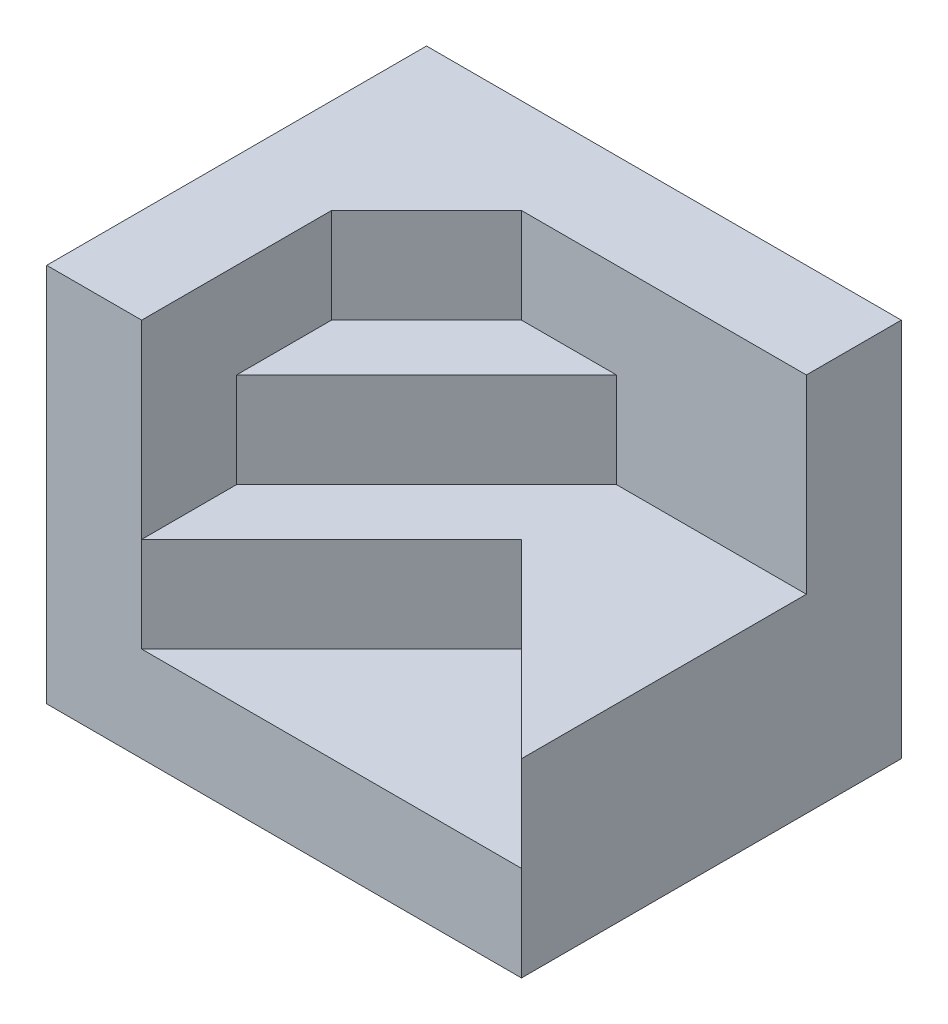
from build123d import *

# Parameters (mm, degrees)
SKETCH1_W      = 50
SKETCH1_H      = 40
EXTRUDE1_DEPTH = 40
EXTRUDE2_DEPTH = 30
EXTRUDE3_DEPTH = 20
EXTRUDE4_DEPTH = 10


with BuildPart() as part:
    # Sketch1 → Extrude1 (new body)
    with BuildSketch(Plane(origin=(0, 0, 0), x_dir=(1, 0, 0), z_dir=(0, 1, 0))):
        Rectangle(SKETCH1_W, SKETCH1_H)
    extrude(amount=EXTRUDE1_DEPTH)

    # Sketch2 → Extrude2 (cut)
    with BuildSketch(Plane(origin=(0, 40, 0), x_dir=(1, 0, 0), z_dir=(0, 1, 0))):
        Polygon((5, 0), (-15, -20), (25, -20), align=None)
    extrude(amount=-EXTRUDE2_DEPTH, mode=Mode.SUBTRACT)

    # Sketch → Extrude3 (cut)
    with BuildSketch(Plane(origin=(0, 40, 0), x_dir=(1, 0, 0), z_dir=(0, 1, 0))):
        Polygon((-15, -10), (-15, -20), (5, 0), (25, -20), (25, 10), (5, 10), align=None)
    extrude(amount=-EXTRUDE3_DEPTH, mode=Mode.SUBTRACT)

    # Sketch 2 → Extrude4 (cut)
    with BuildSketch(Plane(origin=(0, 40, 0), x_dir=(1, 0, 0), z_dir=(0, 1, 0))):
        Polygon((-15, 0), (-15, -10), (5, 10), (-5, 10), align=None)
    extrude(amount=-EXTRUDE4_DEPTH, mode=Mode.SUBTRACT)


solid = part.part
